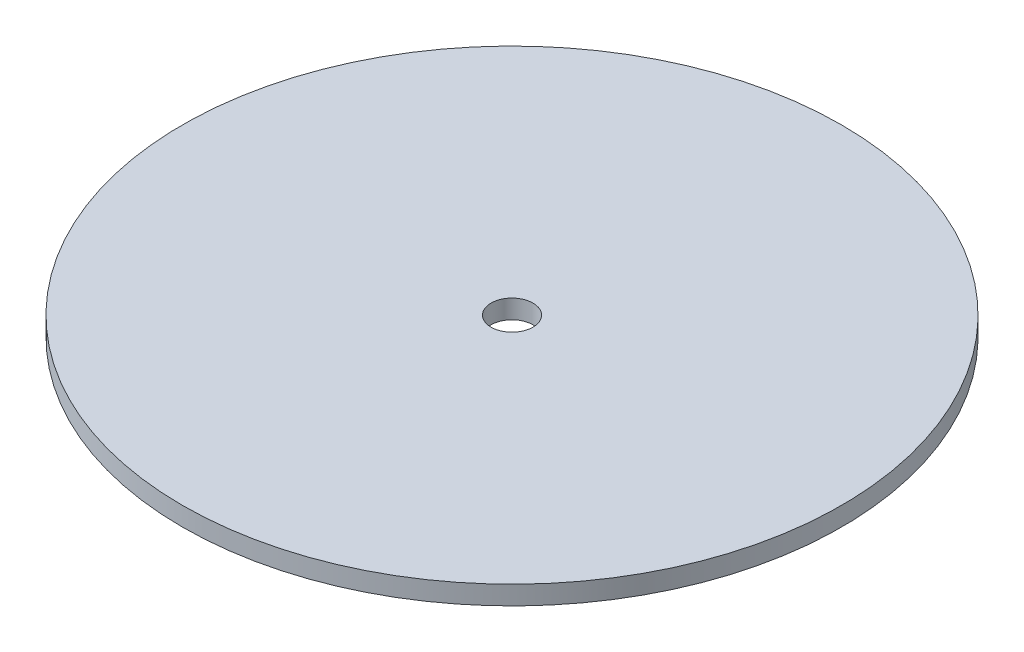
from build123d import *

# Parameters (mm, degrees)
SKETCH1_R           = 31.5
SKETCH1_R_2         = 2
BOSS_EXTRUDE1_DEPTH = 0.9


with BuildPart() as part:
    # Sketch1 → Boss-Extrude1 (new, symmetric)
    with BuildSketch(Plane(origin=(0, 0, 0), x_dir=(1, 0, 0), z_dir=(0, 1, 0))):
        with Locations(Location((0, 0, 0), (0, 0, 270))):
            Circle(SKETCH1_R)
        with Locations(Location((0, 0, 0), (0, 0, 270))):
            Circle(SKETCH1_R_2, mode=Mode.SUBTRACT)
    extrude(amount=BOSS_EXTRUDE1_DEPTH, both=True)


solid = part.part
